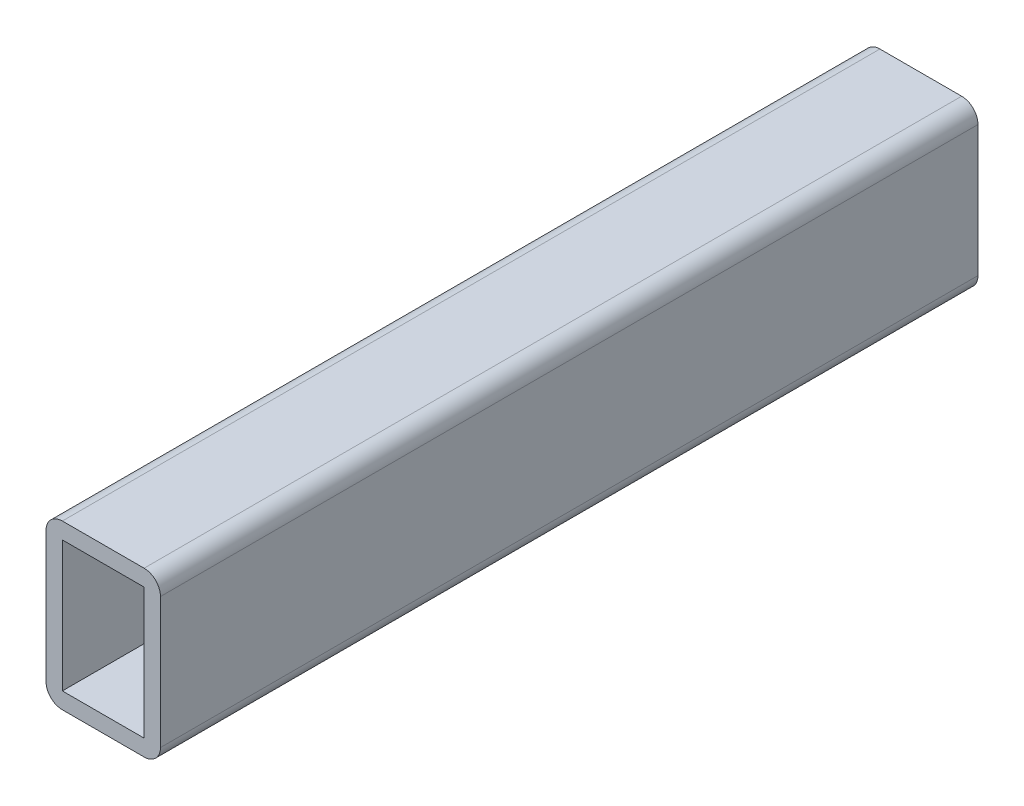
ISO-10303-21;
HEADER;
FILE_DESCRIPTION(('STEP AP214'),'2;1');
FILE_NAME('part.step','',(''),(''),'','','');
FILE_SCHEMA(('AUTOMOTIVE_DESIGN { 1 0 10303 214 1 1 1 1 }'));
ENDSEC;
DATA;
#1=APPLICATION_CONTEXT('core data for automotive mechanical design processes');
#2=APPLICATION_PROTOCOL_DEFINITION('international standard','automotive_design',2000,#1);
#3=PRODUCT_CONTEXT('',#1,'mechanical');
#4=PRODUCT('Part','Part','',(#3));
#5=PRODUCT_RELATED_PRODUCT_CATEGORY('part','',(#4));
#6=PRODUCT_DEFINITION_FORMATION('','',#4);
#7=PRODUCT_DEFINITION_CONTEXT('part definition',#1,'design');
#8=PRODUCT_DEFINITION('design','',#6,#7);
#9=PRODUCT_DEFINITION_SHAPE('','',#8);
#10=(LENGTH_UNIT() NAMED_UNIT(*) SI_UNIT(.MILLI.,.METRE.));
#11=(NAMED_UNIT(*) PLANE_ANGLE_UNIT() SI_UNIT($,.RADIAN.));
#12=(NAMED_UNIT(*) SI_UNIT($,.STERADIAN.) SOLID_ANGLE_UNIT());
#13=UNCERTAINTY_MEASURE_WITH_UNIT(LENGTH_MEASURE(1.E-05),#10,'distance_accuracy_value','');
#14=(GEOMETRIC_REPRESENTATION_CONTEXT(3) GLOBAL_UNCERTAINTY_ASSIGNED_CONTEXT((#13)) GLOBAL_UNIT_ASSIGNED_CONTEXT((#10,
#11,#12)) REPRESENTATION_CONTEXT('',''));
#15=CARTESIAN_POINT('',(0.,0.,0.));
#16=DIRECTION('',(0.,0.,1.));
#17=DIRECTION('',(1.,0.,0.));
#18=AXIS2_PLACEMENT_3D('',#15,#16,#17);
#19=CARTESIAN_POINT('',(-3.5,-5.,25.));
#20=DIRECTION('',(1.,0.,0.));
#21=DIRECTION('',(0.,0.,-1.));
#22=AXIS2_PLACEMENT_3D('',#19,#20,#21);
#23=PLANE('',#22);
#24=CARTESIAN_POINT('',(-3.5,0.,16.5));
#25=DIRECTION('',(-1.,0.,0.));
#26=DIRECTION('',(0.,0.,-1.));
#27=AXIS2_PLACEMENT_3D('',#24,#25,#26);
#28=CIRCLE('',#27,1.5);
#29=CARTESIAN_POINT('',(-3.5,0.,15.));
#30=VERTEX_POINT('',#29);
#31=EDGE_CURVE('E303',#30,#30,#28,.T.);
#32=ORIENTED_EDGE('',*,*,#31,.F.);
#33=EDGE_LOOP('',(#32));
#34=FACE_BOUND('',#33,.T.);
#35=CARTESIAN_POINT('',(-3.5,0.,-16.5));
#36=DIRECTION('',(-1.,0.,0.));
#37=DIRECTION('',(0.,0.,1.));
#38=AXIS2_PLACEMENT_3D('',#35,#36,#37);
#39=CIRCLE('',#38,1.5);
#40=CARTESIAN_POINT('',(-3.5,0.,-15.));
#41=VERTEX_POINT('',#40);
#42=EDGE_CURVE('E307',#41,#41,#39,.T.);
#43=ORIENTED_EDGE('',*,*,#42,.F.);
#44=EDGE_LOOP('',(#43));
#45=FACE_BOUND('',#44,.T.);
#46=DIRECTION('',(0.,-1.,0.));
#47=VECTOR('',#46,1.);
#48=CARTESIAN_POINT('',(-3.5,-5.,-25.));
#49=LINE('',#48,#47);
#50=CARTESIAN_POINT('',(-3.5,4.,-25.));
#51=VERTEX_POINT('',#50);
#52=CARTESIAN_POINT('',(-3.5,-4.,-25.));
#53=VERTEX_POINT('',#52);
#54=EDGE_CURVE('E263',#51,#53,#49,.T.);
#55=ORIENTED_EDGE('',*,*,#54,.T.);
#56=DIRECTION('',(0.,0.,-1.));
#57=VECTOR('',#56,1.);
#58=CARTESIAN_POINT('',(-3.5,-4.,25.));
#59=LINE('',#58,#57);
#60=CARTESIAN_POINT('',(-3.5,-4.,25.));
#61=VERTEX_POINT('',#60);
#62=EDGE_CURVE('E191',#53,#61,#59,.F.);
#63=ORIENTED_EDGE('',*,*,#62,.T.);
#64=DIRECTION('',(0.,-1.,0.));
#65=VECTOR('',#64,1.);
#66=CARTESIAN_POINT('',(-3.5,-5.,25.));
#67=LINE('',#66,#65);
#68=CARTESIAN_POINT('',(-3.5,4.,25.));
#69=VERTEX_POINT('',#68);
#70=EDGE_CURVE('E222',#69,#61,#67,.T.);
#71=ORIENTED_EDGE('',*,*,#70,.F.);
#72=DIRECTION('',(0.,0.,-1.));
#73=VECTOR('',#72,1.);
#74=CARTESIAN_POINT('',(-3.5,4.,25.));
#75=LINE('',#74,#73);
#76=EDGE_CURVE('E187',#69,#51,#75,.T.);
#77=ORIENTED_EDGE('',*,*,#76,.T.);
#78=EDGE_LOOP('',(#55,#63,#71,#77));
#79=FACE_BOUND('',#78,.T.);
#80=ADVANCED_FACE('F36',(#34,#45,#79),#23,.F.);
#81=CARTESIAN_POINT('',(-3.5,-5.,25.));
#82=DIRECTION('',(0.,1.,0.));
#83=DIRECTION('',(0.,0.,1.));
#84=AXIS2_PLACEMENT_3D('',#81,#82,#83);
#85=PLANE('',#84);
#86=DIRECTION('',(1.,0.,0.));
#87=VECTOR('',#86,1.);
#88=CARTESIAN_POINT('',(-3.5,-5.,25.));
#89=LINE('',#88,#87);
#90=CARTESIAN_POINT('',(-2.5,-5.,25.));
#91=VERTEX_POINT('',#90);
#92=CARTESIAN_POINT('',(2.5,-5.,25.));
#93=VERTEX_POINT('',#92);
#94=EDGE_CURVE('E226',#91,#93,#89,.T.);
#95=ORIENTED_EDGE('',*,*,#94,.F.);
#96=DIRECTION('',(0.,0.,-1.));
#97=VECTOR('',#96,1.);
#98=CARTESIAN_POINT('',(-2.5,-5.,25.));
#99=LINE('',#98,#97);
#100=CARTESIAN_POINT('',(-2.5,-5.,-25.));
#101=VERTEX_POINT('',#100);
#102=EDGE_CURVE('E168',#91,#101,#99,.T.);
#103=ORIENTED_EDGE('',*,*,#102,.T.);
#104=DIRECTION('',(1.,0.,0.));
#105=VECTOR('',#104,1.);
#106=CARTESIAN_POINT('',(-3.5,-5.,-25.));
#107=LINE('',#106,#105);
#108=CARTESIAN_POINT('',(2.5,-5.,-25.));
#109=VERTEX_POINT('',#108);
#110=EDGE_CURVE('E229',#101,#109,#107,.T.);
#111=ORIENTED_EDGE('',*,*,#110,.T.);
#112=DIRECTION('',(0.,0.,-1.));
#113=VECTOR('',#112,1.);
#114=CARTESIAN_POINT('',(2.5,-5.,25.));
#115=LINE('',#114,#113);
#116=EDGE_CURVE('E164',#109,#93,#115,.F.);
#117=ORIENTED_EDGE('',*,*,#116,.T.);
#118=EDGE_LOOP('',(#95,#103,#111,#117));
#119=FACE_BOUND('',#118,.T.);
#120=ADVANCED_FACE('F270',(#119),#85,.F.);
#121=CARTESIAN_POINT('',(3.5,-5.,25.));
#122=DIRECTION('',(-1.,0.,0.));
#123=DIRECTION('',(0.,0.,1.));
#124=AXIS2_PLACEMENT_3D('',#121,#122,#123);
#125=PLANE('',#124);
#126=DIRECTION('',(0.,1.,0.));
#127=VECTOR('',#126,1.);
#128=CARTESIAN_POINT('',(3.5,-5.,25.));
#129=LINE('',#128,#127);
#130=CARTESIAN_POINT('',(3.5,-4.,25.));
#131=VERTEX_POINT('',#130);
#132=CARTESIAN_POINT('',(3.5,4.,25.));
#133=VERTEX_POINT('',#132);
#134=EDGE_CURVE('E236',#131,#133,#129,.T.);
#135=ORIENTED_EDGE('',*,*,#134,.F.);
#136=DIRECTION('',(0.,0.,-1.));
#137=VECTOR('',#136,1.);
#138=CARTESIAN_POINT('',(3.5,-4.,25.));
#139=LINE('',#138,#137);
#140=CARTESIAN_POINT('',(3.5,-4.,-25.));
#141=VERTEX_POINT('',#140);
#142=EDGE_CURVE('E205',#131,#141,#139,.T.);
#143=ORIENTED_EDGE('',*,*,#142,.T.);
#144=DIRECTION('',(0.,1.,0.));
#145=VECTOR('',#144,1.);
#146=CARTESIAN_POINT('',(3.5,-5.,-25.));
#147=LINE('',#146,#145);
#148=CARTESIAN_POINT('',(3.5,4.,-25.));
#149=VERTEX_POINT('',#148);
#150=EDGE_CURVE('E223',#141,#149,#147,.T.);
#151=ORIENTED_EDGE('',*,*,#150,.T.);
#152=DIRECTION('',(0.,0.,-1.));
#153=VECTOR('',#152,1.);
#154=CARTESIAN_POINT('',(3.5,4.,25.));
#155=LINE('',#154,#153);
#156=EDGE_CURVE('E202',#149,#133,#155,.F.);
#157=ORIENTED_EDGE('',*,*,#156,.T.);
#158=EDGE_LOOP('',(#135,#143,#151,#157));
#159=FACE_BOUND('',#158,.T.);
#160=ADVANCED_FACE('F279',(#159),#125,.F.);
#161=CARTESIAN_POINT('',(-3.5,5.,25.));
#162=DIRECTION('',(0.,-1.,0.));
#163=DIRECTION('',(0.,0.,-1.));
#164=AXIS2_PLACEMENT_3D('',#161,#162,#163);
#165=PLANE('',#164);
#166=DIRECTION('',(-1.,0.,0.));
#167=VECTOR('',#166,1.);
#168=CARTESIAN_POINT('',(-3.5,5.,-25.));
#169=LINE('',#168,#167);
#170=CARTESIAN_POINT('',(2.5,5.,-25.));
#171=VERTEX_POINT('',#170);
#172=CARTESIAN_POINT('',(-2.5,5.,-25.));
#173=VERTEX_POINT('',#172);
#174=EDGE_CURVE('E215',#171,#173,#169,.T.);
#175=ORIENTED_EDGE('',*,*,#174,.T.);
#176=DIRECTION('',(0.,0.,-1.));
#177=VECTOR('',#176,1.);
#178=CARTESIAN_POINT('',(-2.5,5.,25.));
#179=LINE('',#178,#177);
#180=CARTESIAN_POINT('',(-2.5,5.,25.));
#181=VERTEX_POINT('',#180);
#182=EDGE_CURVE('E11',#173,#181,#179,.F.);
#183=ORIENTED_EDGE('',*,*,#182,.T.);
#184=DIRECTION('',(-1.,0.,0.));
#185=VECTOR('',#184,1.);
#186=CARTESIAN_POINT('',(-3.5,5.,25.));
#187=LINE('',#186,#185);
#188=CARTESIAN_POINT('',(2.5,5.,25.));
#189=VERTEX_POINT('',#188);
#190=EDGE_CURVE('E146',#189,#181,#187,.T.);
#191=ORIENTED_EDGE('',*,*,#190,.F.);
#192=DIRECTION('',(0.,0.,-1.));
#193=VECTOR('',#192,1.);
#194=CARTESIAN_POINT('',(2.5,5.,25.));
#195=LINE('',#194,#193);
#196=EDGE_CURVE('E44',#189,#171,#195,.T.);
#197=ORIENTED_EDGE('',*,*,#196,.T.);
#198=EDGE_LOOP('',(#175,#183,#191,#197));
#199=FACE_BOUND('',#198,.T.);
#200=ADVANCED_FACE('F214',(#199),#165,.F.);
#201=CARTESIAN_POINT('',(-3.5,5.,25.));
#202=DIRECTION('',(0.,0.,-1.));
#203=DIRECTION('',(-1.,0.,0.));
#204=AXIS2_PLACEMENT_3D('',#201,#202,#203);
#205=PLANE('',#204);
#206=DIRECTION('',(-1.,0.,0.));
#207=VECTOR('',#206,1.);
#208=CARTESIAN_POINT('',(-3.5,-4.,25.));
#209=LINE('',#208,#207);
#210=CARTESIAN_POINT('',(2.5,-4.,25.));
#211=VERTEX_POINT('',#210);
#212=CARTESIAN_POINT('',(-2.5,-4.,25.));
#213=VERTEX_POINT('',#212);
#214=EDGE_CURVE('E250',#211,#213,#209,.T.);
#215=ORIENTED_EDGE('',*,*,#214,.T.);
#216=DIRECTION('',(0.,1.,0.));
#217=VECTOR('',#216,1.);
#218=CARTESIAN_POINT('',(-2.5,5.,25.));
#219=LINE('',#218,#217);
#220=CARTESIAN_POINT('',(-2.5,4.,25.));
#221=VERTEX_POINT('',#220);
#222=EDGE_CURVE('E154',#213,#221,#219,.T.);
#223=ORIENTED_EDGE('',*,*,#222,.T.);
#224=DIRECTION('',(1.,0.,0.));
#225=VECTOR('',#224,1.);
#226=CARTESIAN_POINT('',(-3.5,4.,25.));
#227=LINE('',#226,#225);
#228=CARTESIAN_POINT('',(2.5,4.,25.));
#229=VERTEX_POINT('',#228);
#230=EDGE_CURVE('E260',#221,#229,#227,.T.);
#231=ORIENTED_EDGE('',*,*,#230,.T.);
#232=DIRECTION('',(0.,-1.,0.));
#233=VECTOR('',#232,1.);
#234=CARTESIAN_POINT('',(2.5,5.,25.));
#235=LINE('',#234,#233);
#236=EDGE_CURVE('E244',#229,#211,#235,.T.);
#237=ORIENTED_EDGE('',*,*,#236,.T.);
#238=EDGE_LOOP('',(#215,#223,#231,#237));
#239=FACE_BOUND('',#238,.T.);
#240=ORIENTED_EDGE('',*,*,#70,.T.);
#241=CARTESIAN_POINT('',(-2.5,-4.,25.));
#242=DIRECTION('',(0.,0.,-1.));
#243=DIRECTION('',(-1.,0.,0.));
#244=AXIS2_PLACEMENT_3D('',#241,#242,#243);
#245=CIRCLE('',#244,1.);
#246=EDGE_CURVE('E199',#61,#91,#245,.F.);
#247=ORIENTED_EDGE('',*,*,#246,.T.);
#248=ORIENTED_EDGE('',*,*,#94,.T.);
#249=CARTESIAN_POINT('',(2.5,-4.,25.));
#250=DIRECTION('',(0.,0.,-1.));
#251=DIRECTION('',(-1.,0.,0.));
#252=AXIS2_PLACEMENT_3D('',#249,#250,#251);
#253=CIRCLE('',#252,1.);
#254=EDGE_CURVE('E197',#93,#131,#253,.F.);
#255=ORIENTED_EDGE('',*,*,#254,.T.);
#256=ORIENTED_EDGE('',*,*,#134,.T.);
#257=CARTESIAN_POINT('',(2.5,4.,25.));
#258=DIRECTION('',(0.,0.,-1.));
#259=DIRECTION('',(-1.,0.,0.));
#260=AXIS2_PLACEMENT_3D('',#257,#258,#259);
#261=CIRCLE('',#260,1.);
#262=EDGE_CURVE('E56',#133,#189,#261,.F.);
#263=ORIENTED_EDGE('',*,*,#262,.T.);
#264=ORIENTED_EDGE('',*,*,#190,.T.);
#265=CARTESIAN_POINT('',(-2.5,4.,25.));
#266=DIRECTION('',(0.,0.,-1.));
#267=DIRECTION('',(-1.,0.,0.));
#268=AXIS2_PLACEMENT_3D('',#265,#266,#267);
#269=CIRCLE('',#268,1.);
#270=EDGE_CURVE('E195',#181,#69,#269,.F.);
#271=ORIENTED_EDGE('',*,*,#270,.T.);
#272=EDGE_LOOP('',(#240,#247,#248,#255,#256,#263,#264,#271));
#273=FACE_BOUND('',#272,.T.);
#274=ADVANCED_FACE('F277',(#239,#273),#205,.F.);
#275=CARTESIAN_POINT('',(-3.5,5.,-25.));
#276=DIRECTION('',(0.,0.,-1.));
#277=DIRECTION('',(-1.,0.,0.));
#278=AXIS2_PLACEMENT_3D('',#275,#276,#277);
#279=PLANE('',#278);
#280=DIRECTION('',(0.,1.,0.));
#281=VECTOR('',#280,1.);
#282=CARTESIAN_POINT('',(-2.5,5.,-25.));
#283=LINE('',#282,#281);
#284=CARTESIAN_POINT('',(-2.5,-4.,-25.));
#285=VERTEX_POINT('',#284);
#286=CARTESIAN_POINT('',(-2.5,4.,-25.));
#287=VERTEX_POINT('',#286);
#288=EDGE_CURVE('E151',#285,#287,#283,.T.);
#289=ORIENTED_EDGE('',*,*,#288,.F.);
#290=DIRECTION('',(-1.,0.,0.));
#291=VECTOR('',#290,1.);
#292=CARTESIAN_POINT('',(-3.5,-4.,-25.));
#293=LINE('',#292,#291);
#294=CARTESIAN_POINT('',(2.5,-4.,-25.));
#295=VERTEX_POINT('',#294);
#296=EDGE_CURVE('E133',#295,#285,#293,.T.);
#297=ORIENTED_EDGE('',*,*,#296,.F.);
#298=DIRECTION('',(0.,-1.,0.));
#299=VECTOR('',#298,1.);
#300=CARTESIAN_POINT('',(2.5,5.,-25.));
#301=LINE('',#300,#299);
#302=CARTESIAN_POINT('',(2.5,4.,-25.));
#303=VERTEX_POINT('',#302);
#304=EDGE_CURVE('E145',#303,#295,#301,.T.);
#305=ORIENTED_EDGE('',*,*,#304,.F.);
#306=DIRECTION('',(1.,0.,0.));
#307=VECTOR('',#306,1.);
#308=CARTESIAN_POINT('',(-3.5,4.,-25.));
#309=LINE('',#308,#307);
#310=EDGE_CURVE('E162',#287,#303,#309,.T.);
#311=ORIENTED_EDGE('',*,*,#310,.F.);
#312=EDGE_LOOP('',(#289,#297,#305,#311));
#313=FACE_BOUND('',#312,.T.);
#314=ORIENTED_EDGE('',*,*,#110,.F.);
#315=CARTESIAN_POINT('',(-2.5,-4.,-25.));
#316=DIRECTION('',(0.,0.,-1.));
#317=DIRECTION('',(-1.,0.,0.));
#318=AXIS2_PLACEMENT_3D('',#315,#316,#317);
#319=CIRCLE('',#318,1.);
#320=EDGE_CURVE('E184',#101,#53,#319,.T.);
#321=ORIENTED_EDGE('',*,*,#320,.T.);
#322=ORIENTED_EDGE('',*,*,#54,.F.);
#323=CARTESIAN_POINT('',(-2.5,4.,-25.));
#324=DIRECTION('',(0.,0.,-1.));
#325=DIRECTION('',(-1.,0.,0.));
#326=AXIS2_PLACEMENT_3D('',#323,#324,#325);
#327=CIRCLE('',#326,1.);
#328=EDGE_CURVE('E180',#51,#173,#327,.T.);
#329=ORIENTED_EDGE('',*,*,#328,.T.);
#330=ORIENTED_EDGE('',*,*,#174,.F.);
#331=CARTESIAN_POINT('',(2.5,4.,-25.));
#332=DIRECTION('',(0.,0.,-1.));
#333=DIRECTION('',(-1.,0.,0.));
#334=AXIS2_PLACEMENT_3D('',#331,#332,#333);
#335=CIRCLE('',#334,1.);
#336=EDGE_CURVE('E177',#171,#149,#335,.T.);
#337=ORIENTED_EDGE('',*,*,#336,.T.);
#338=ORIENTED_EDGE('',*,*,#150,.F.);
#339=CARTESIAN_POINT('',(2.5,-4.,-25.));
#340=DIRECTION('',(0.,0.,-1.));
#341=DIRECTION('',(-1.,0.,0.));
#342=AXIS2_PLACEMENT_3D('',#339,#340,#341);
#343=CIRCLE('',#342,1.);
#344=EDGE_CURVE('E182',#141,#109,#343,.T.);
#345=ORIENTED_EDGE('',*,*,#344,.T.);
#346=EDGE_LOOP('',(#314,#321,#322,#329,#330,#337,#338,#345));
#347=FACE_BOUND('',#346,.T.);
#348=ADVANCED_FACE('F160',(#313,#347),#279,.T.);
#349=CARTESIAN_POINT('',(-2.5,-4.,-50.));
#350=DIRECTION('',(-1.,0.,0.));
#351=DIRECTION('',(0.,0.,1.));
#352=AXIS2_PLACEMENT_3D('',#349,#350,#351);
#353=PLANE('',#352);
#354=CARTESIAN_POINT('',(-2.5,0.,16.5));
#355=DIRECTION('',(-1.,0.,0.));
#356=DIRECTION('',(0.,0.,-1.));
#357=AXIS2_PLACEMENT_3D('',#354,#355,#356);
#358=CIRCLE('',#357,1.5);
#359=CARTESIAN_POINT('',(-2.5,0.,15.));
#360=VERTEX_POINT('',#359);
#361=EDGE_CURVE('E405',#360,#360,#358,.T.);
#362=ORIENTED_EDGE('',*,*,#361,.T.);
#363=EDGE_LOOP('',(#362));
#364=FACE_BOUND('',#363,.T.);
#365=CARTESIAN_POINT('',(-2.5,0.,-16.5));
#366=DIRECTION('',(-1.,0.,0.));
#367=DIRECTION('',(0.,0.,1.));
#368=AXIS2_PLACEMENT_3D('',#365,#366,#367);
#369=CIRCLE('',#368,1.5);
#370=CARTESIAN_POINT('',(-2.5,0.,-15.));
#371=VERTEX_POINT('',#370);
#372=EDGE_CURVE('E157',#371,#371,#369,.T.);
#373=ORIENTED_EDGE('',*,*,#372,.T.);
#374=EDGE_LOOP('',(#373));
#375=FACE_BOUND('',#374,.T.);
#376=DIRECTION('',(0.,0.,1.));
#377=VECTOR('',#376,1.);
#378=CARTESIAN_POINT('',(-2.5,-4.,-50.));
#379=LINE('',#378,#377);
#380=EDGE_CURVE('E136',#285,#213,#379,.T.);
#381=ORIENTED_EDGE('',*,*,#380,.F.);
#382=ORIENTED_EDGE('',*,*,#288,.T.);
#383=DIRECTION('',(0.,0.,1.));
#384=VECTOR('',#383,1.);
#385=CARTESIAN_POINT('',(-2.5,4.,-50.));
#386=LINE('',#385,#384);
#387=EDGE_CURVE('E247',#287,#221,#386,.T.);
#388=ORIENTED_EDGE('',*,*,#387,.T.);
#389=ORIENTED_EDGE('',*,*,#222,.F.);
#390=EDGE_LOOP('',(#381,#382,#388,#389));
#391=FACE_BOUND('',#390,.T.);
#392=ADVANCED_FACE('F149',(#364,#375,#391),#353,.F.);
#393=CARTESIAN_POINT('',(-2.5,4.,-50.));
#394=DIRECTION('',(0.,1.,0.));
#395=DIRECTION('',(0.,0.,1.));
#396=AXIS2_PLACEMENT_3D('',#393,#394,#395);
#397=PLANE('',#396);
#398=ORIENTED_EDGE('',*,*,#387,.F.);
#399=ORIENTED_EDGE('',*,*,#310,.T.);
#400=DIRECTION('',(0.,0.,1.));
#401=VECTOR('',#400,1.);
#402=CARTESIAN_POINT('',(2.5,4.,-50.));
#403=LINE('',#402,#401);
#404=EDGE_CURVE('E243',#303,#229,#403,.T.);
#405=ORIENTED_EDGE('',*,*,#404,.T.);
#406=ORIENTED_EDGE('',*,*,#230,.F.);
#407=EDGE_LOOP('',(#398,#399,#405,#406));
#408=FACE_BOUND('',#407,.T.);
#409=ADVANCED_FACE('F324',(#408),#397,.F.);
#410=CARTESIAN_POINT('',(2.5,-4.,-50.));
#411=DIRECTION('',(1.,0.,0.));
#412=DIRECTION('',(0.,1.,0.));
#413=AXIS2_PLACEMENT_3D('',#410,#411,#412);
#414=PLANE('',#413);
#415=ORIENTED_EDGE('',*,*,#404,.F.);
#416=ORIENTED_EDGE('',*,*,#304,.T.);
#417=DIRECTION('',(0.,0.,1.));
#418=VECTOR('',#417,1.);
#419=CARTESIAN_POINT('',(2.5,-4.,-50.));
#420=LINE('',#419,#418);
#421=EDGE_CURVE('E139',#295,#211,#420,.T.);
#422=ORIENTED_EDGE('',*,*,#421,.T.);
#423=ORIENTED_EDGE('',*,*,#236,.F.);
#424=EDGE_LOOP('',(#415,#416,#422,#423));
#425=FACE_BOUND('',#424,.T.);
#426=ADVANCED_FACE('F240',(#425),#414,.F.);
#427=CARTESIAN_POINT('',(-2.5,-4.,-50.));
#428=DIRECTION('',(0.,-1.,0.));
#429=DIRECTION('',(0.,0.,-1.));
#430=AXIS2_PLACEMENT_3D('',#427,#428,#429);
#431=PLANE('',#430);
#432=ORIENTED_EDGE('',*,*,#421,.F.);
#433=ORIENTED_EDGE('',*,*,#296,.T.);
#434=ORIENTED_EDGE('',*,*,#380,.T.);
#435=ORIENTED_EDGE('',*,*,#214,.F.);
#436=EDGE_LOOP('',(#432,#433,#434,#435));
#437=FACE_BOUND('',#436,.T.);
#438=ADVANCED_FACE('F135',(#437),#431,.F.);
#439=CARTESIAN_POINT('',(-2.5,-4.,25.));
#440=DIRECTION('',(0.,0.,-1.));
#441=DIRECTION('',(-1.,0.,0.));
#442=AXIS2_PLACEMENT_3D('',#439,#440,#441);
#443=CYLINDRICAL_SURFACE('',#442,1.);
#444=ORIENTED_EDGE('',*,*,#246,.F.);
#445=ORIENTED_EDGE('',*,*,#62,.F.);
#446=ORIENTED_EDGE('',*,*,#320,.F.);
#447=ORIENTED_EDGE('',*,*,#102,.F.);
#448=EDGE_LOOP('',(#444,#445,#446,#447));
#449=FACE_BOUND('',#448,.T.);
#450=ADVANCED_FACE('F313',(#449),#443,.T.);
#451=CARTESIAN_POINT('',(2.5,-4.,25.));
#452=DIRECTION('',(0.,0.,-1.));
#453=DIRECTION('',(-1.,0.,0.));
#454=AXIS2_PLACEMENT_3D('',#451,#452,#453);
#455=CYLINDRICAL_SURFACE('',#454,1.);
#456=ORIENTED_EDGE('',*,*,#254,.F.);
#457=ORIENTED_EDGE('',*,*,#116,.F.);
#458=ORIENTED_EDGE('',*,*,#344,.F.);
#459=ORIENTED_EDGE('',*,*,#142,.F.);
#460=EDGE_LOOP('',(#456,#457,#458,#459));
#461=FACE_BOUND('',#460,.T.);
#462=ADVANCED_FACE('F274',(#461),#455,.T.);
#463=CARTESIAN_POINT('',(-2.5,4.,25.));
#464=DIRECTION('',(0.,0.,-1.));
#465=DIRECTION('',(-1.,0.,0.));
#466=AXIS2_PLACEMENT_3D('',#463,#464,#465);
#467=CYLINDRICAL_SURFACE('',#466,1.);
#468=ORIENTED_EDGE('',*,*,#270,.F.);
#469=ORIENTED_EDGE('',*,*,#182,.F.);
#470=ORIENTED_EDGE('',*,*,#328,.F.);
#471=ORIENTED_EDGE('',*,*,#76,.F.);
#472=EDGE_LOOP('',(#468,#469,#470,#471));
#473=FACE_BOUND('',#472,.T.);
#474=ADVANCED_FACE('F284',(#473),#467,.T.);
#475=CARTESIAN_POINT('',(2.5,4.,25.));
#476=DIRECTION('',(0.,0.,-1.));
#477=DIRECTION('',(-1.,0.,0.));
#478=AXIS2_PLACEMENT_3D('',#475,#476,#477);
#479=CYLINDRICAL_SURFACE('',#478,1.);
#480=ORIENTED_EDGE('',*,*,#262,.F.);
#481=ORIENTED_EDGE('',*,*,#156,.F.);
#482=ORIENTED_EDGE('',*,*,#336,.F.);
#483=ORIENTED_EDGE('',*,*,#196,.F.);
#484=EDGE_LOOP('',(#480,#481,#482,#483));
#485=FACE_BOUND('',#484,.T.);
#486=ADVANCED_FACE('F281',(#485),#479,.T.);
#487=CARTESIAN_POINT('',(-2.5,0.,-16.5));
#488=DIRECTION('',(-1.,0.,0.));
#489=DIRECTION('',(0.,0.,1.));
#490=AXIS2_PLACEMENT_3D('',#487,#488,#489);
#491=CYLINDRICAL_SURFACE('',#490,1.5);
#492=ORIENTED_EDGE('',*,*,#372,.F.);
#493=EDGE_LOOP('',(#492));
#494=FACE_BOUND('',#493,.T.);
#495=ORIENTED_EDGE('',*,*,#42,.T.);
#496=EDGE_LOOP('',(#495));
#497=FACE_BOUND('',#496,.T.);
#498=ADVANCED_FACE('F283',(#494,#497),#491,.F.);
#499=CARTESIAN_POINT('',(-2.5,0.,16.5));
#500=DIRECTION('',(-1.,0.,0.));
#501=DIRECTION('',(0.,0.,1.));
#502=AXIS2_PLACEMENT_3D('',#499,#500,#501);
#503=CYLINDRICAL_SURFACE('',#502,1.5);
#504=ORIENTED_EDGE('',*,*,#361,.F.);
#505=EDGE_LOOP('',(#504));
#506=FACE_BOUND('',#505,.T.);
#507=ORIENTED_EDGE('',*,*,#31,.T.);
#508=EDGE_LOOP('',(#507));
#509=FACE_BOUND('',#508,.T.);
#510=ADVANCED_FACE('F290',(#506,#509),#503,.F.);
#511=CLOSED_SHELL('',(#80,#120,#160,#200,#274,#348,#392,#409,#426,#438,#450,#462,#474,#486,#498,#510));
#512=MANIFOLD_SOLID_BREP('B2',#511);
#513=ADVANCED_BREP_SHAPE_REPRESENTATION('',(#18,#512),#14);
#514=SHAPE_DEFINITION_REPRESENTATION(#9,#513);
ENDSEC;
END-ISO-10303-21;
